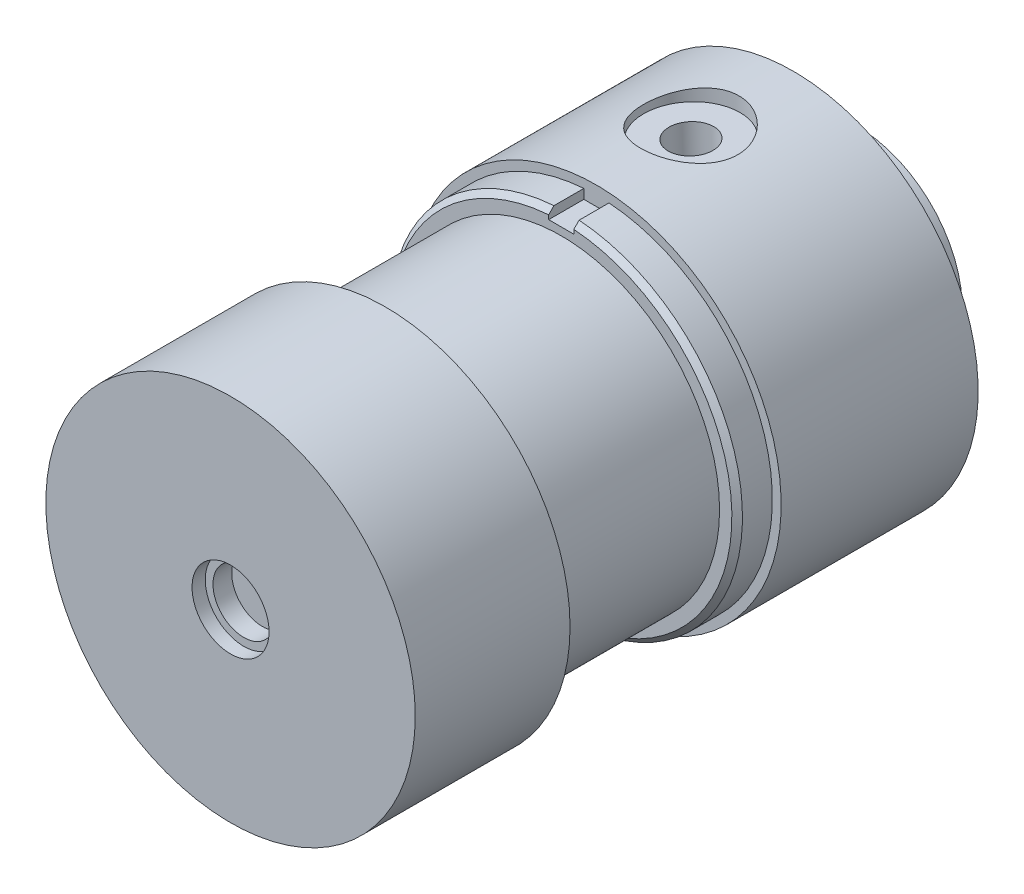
ISO-10303-21;
HEADER;
FILE_DESCRIPTION(('STEP AP214'),'2;1');
FILE_NAME('part.step','',(''),(''),'','','');
FILE_SCHEMA(('AUTOMOTIVE_DESIGN { 1 0 10303 214 1 1 1 1 }'));
ENDSEC;
DATA;
#1=APPLICATION_CONTEXT('core data for automotive mechanical design processes');
#2=APPLICATION_PROTOCOL_DEFINITION('international standard','automotive_design',2000,#1);
#3=PRODUCT_CONTEXT('',#1,'mechanical');
#4=PRODUCT('Part','Part','',(#3));
#5=PRODUCT_RELATED_PRODUCT_CATEGORY('part','',(#4));
#6=PRODUCT_DEFINITION_FORMATION('','',#4);
#7=PRODUCT_DEFINITION_CONTEXT('part definition',#1,'design');
#8=PRODUCT_DEFINITION('design','',#6,#7);
#9=PRODUCT_DEFINITION_SHAPE('','',#8);
#10=(LENGTH_UNIT() NAMED_UNIT(*) SI_UNIT(.MILLI.,.METRE.));
#11=(NAMED_UNIT(*) PLANE_ANGLE_UNIT() SI_UNIT($,.RADIAN.));
#12=(NAMED_UNIT(*) SI_UNIT($,.STERADIAN.) SOLID_ANGLE_UNIT());
#13=UNCERTAINTY_MEASURE_WITH_UNIT(LENGTH_MEASURE(1.E-05),#10,'distance_accuracy_value','');
#14=(GEOMETRIC_REPRESENTATION_CONTEXT(3) GLOBAL_UNCERTAINTY_ASSIGNED_CONTEXT((#13)) GLOBAL_UNIT_ASSIGNED_CONTEXT((#10,
#11,#12)) REPRESENTATION_CONTEXT('',''));
#15=CARTESIAN_POINT('',(0.,0.,0.));
#16=DIRECTION('',(0.,0.,1.));
#17=DIRECTION('',(1.,0.,0.));
#18=AXIS2_PLACEMENT_3D('',#15,#16,#17);
#19=CARTESIAN_POINT('',(0.00558795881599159,-0.145103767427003,24.8616081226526));
#20=DIRECTION('',(0.,0.,-1.));
#21=DIRECTION('',(-1.,0.,0.));
#22=AXIS2_PLACEMENT_3D('',#19,#20,#21);
#23=CYLINDRICAL_SURFACE('',#22,75.);
#24=DIRECTION('',(0.,0.,-1.));
#25=VECTOR('',#24,1.);
#26=CARTESIAN_POINT('',(5.36808795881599,74.6629412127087,24.8616081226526));
#27=LINE('',#26,#25);
#28=CARTESIAN_POINT('',(5.36808795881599,74.6629412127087,22.6116081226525));
#29=VERTEX_POINT('',#28);
#30=CARTESIAN_POINT('',(5.36808795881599,74.6629412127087,9.86160812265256));
#31=VERTEX_POINT('',#30);
#32=EDGE_CURVE('E160',#29,#31,#27,.T.);
#33=ORIENTED_EDGE('',*,*,#32,.F.);
#34=CARTESIAN_POINT('',(0.00558795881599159,-0.145103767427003,22.6116081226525));
#35=DIRECTION('',(0.,0.,1.));
#36=DIRECTION('',(1.,0.,0.));
#37=AXIS2_PLACEMENT_3D('',#34,#35,#36);
#38=CIRCLE('',#37,75.);
#39=CARTESIAN_POINT('',(-5.35691204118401,74.6629412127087,22.6116081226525));
#40=VERTEX_POINT('',#39);
#41=EDGE_CURVE('E65',#29,#40,#38,.F.);
#42=ORIENTED_EDGE('',*,*,#41,.T.);
#43=DIRECTION('',(0.,0.,-1.));
#44=VECTOR('',#43,1.);
#45=CARTESIAN_POINT('',(-5.35691204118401,74.6629412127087,24.8616081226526));
#46=LINE('',#45,#44);
#47=CARTESIAN_POINT('',(-5.35691204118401,74.6629412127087,9.86160812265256));
#48=VERTEX_POINT('',#47);
#49=EDGE_CURVE('E170',#40,#48,#46,.T.);
#50=ORIENTED_EDGE('',*,*,#49,.T.);
#51=CARTESIAN_POINT('',(0.00558795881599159,-0.145103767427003,9.86160812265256));
#52=DIRECTION('',(0.,0.,1.));
#53=DIRECTION('',(1.,0.,0.));
#54=AXIS2_PLACEMENT_3D('',#51,#52,#53);
#55=CIRCLE('',#54,75.);
#56=EDGE_CURVE('E112',#48,#31,#55,.T.);
#57=ORIENTED_EDGE('',*,*,#56,.T.);
#58=EDGE_LOOP('',(#33,#42,#50,#57));
#59=FACE_BOUND('',#58,.T.);
#60=ADVANCED_FACE('F50',(#59),#23,.T.);
#61=CARTESIAN_POINT('',(0.00558795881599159,-0.145103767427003,24.8616081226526));
#62=DIRECTION('',(0.,0.,1.));
#63=DIRECTION('',(1.,0.,0.));
#64=AXIS2_PLACEMENT_3D('',#61,#62,#63);
#65=PLANE('',#64);
#66=DIRECTION('',(0.,1.,0.));
#67=VECTOR('',#66,1.);
#68=CARTESIAN_POINT('',(-5.35691204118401,70.6129412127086,24.8616081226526));
#69=LINE('',#68,#67);
#70=CARTESIAN_POINT('',(-5.35691204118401,70.6129412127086,24.8616081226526));
#71=VERTEX_POINT('',#70);
#72=CARTESIAN_POINT('',(-5.35691204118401,72.4069885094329,24.8616081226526));
#73=VERTEX_POINT('',#72);
#74=EDGE_CURVE('E115',#71,#73,#69,.T.);
#75=ORIENTED_EDGE('',*,*,#74,.T.);
#76=CARTESIAN_POINT('',(0.00558795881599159,-0.145103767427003,24.8616081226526));
#77=DIRECTION('',(0.,0.,1.));
#78=DIRECTION('',(1.,0.,0.));
#79=AXIS2_PLACEMENT_3D('',#76,#77,#78);
#80=CIRCLE('',#79,72.75);
#81=CARTESIAN_POINT('',(5.36808795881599,72.4069885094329,24.8616081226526));
#82=VERTEX_POINT('',#81);
#83=EDGE_CURVE('E184',#73,#82,#80,.T.);
#84=ORIENTED_EDGE('',*,*,#83,.T.);
#85=DIRECTION('',(0.,1.,0.));
#86=VECTOR('',#85,1.);
#87=CARTESIAN_POINT('',(5.36808795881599,70.6129412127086,24.8616081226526));
#88=LINE('',#87,#86);
#89=CARTESIAN_POINT('',(5.36808795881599,70.6129412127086,24.8616081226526));
#90=VERTEX_POINT('',#89);
#91=EDGE_CURVE('E146',#90,#82,#88,.T.);
#92=ORIENTED_EDGE('',*,*,#91,.F.);
#93=DIRECTION('',(1.,0.,0.));
#94=VECTOR('',#93,1.);
#95=CARTESIAN_POINT('',(5.36808795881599,70.6129412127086,24.8616081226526));
#96=LINE('',#95,#94);
#97=EDGE_CURVE('E125',#71,#90,#96,.T.);
#98=ORIENTED_EDGE('',*,*,#97,.F.);
#99=EDGE_LOOP('',(#75,#84,#92,#98));
#100=FACE_BOUND('',#99,.T.);
#101=CARTESIAN_POINT('',(0.00558795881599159,-0.145103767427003,24.8616081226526));
#102=DIRECTION('',(0.,0.,1.));
#103=DIRECTION('',(1.,0.,0.));
#104=AXIS2_PLACEMENT_3D('',#101,#102,#103);
#105=CIRCLE('',#104,67.5);
#106=CARTESIAN_POINT('',(67.505587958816,-0.145103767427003,24.8616081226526));
#107=VERTEX_POINT('',#106);
#108=EDGE_CURVE('E155',#107,#107,#105,.T.);
#109=ORIENTED_EDGE('',*,*,#108,.F.);
#110=EDGE_LOOP('',(#109));
#111=FACE_BOUND('',#110,.T.);
#112=ADVANCED_FACE('F272',(#100,#111),#65,.T.);
#113=CARTESIAN_POINT('',(0.00558795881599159,-0.145103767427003,-74.1383918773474));
#114=DIRECTION('',(0.,0.,1.));
#115=DIRECTION('',(1.,0.,0.));
#116=AXIS2_PLACEMENT_3D('',#113,#114,#115);
#117=CYLINDRICAL_SURFACE('',#116,78.75);
#118=CARTESIAN_POINT('',(-23.1964049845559,75.1093314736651,-33.3472685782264));
#119=CARTESIAN_POINT('',(-23.1964027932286,75.1093329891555,-33.9036627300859));
#120=CARTESIAN_POINT('',(-23.1736237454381,75.1163668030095,-34.4601011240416));
#121=CARTESIAN_POINT('',(-23.0826919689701,75.1443114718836,-35.568939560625));
#122=CARTESIAN_POINT('',(-23.0145343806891,75.1652238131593,-36.1213391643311));
#123=CARTESIAN_POINT('',(-22.8333720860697,75.2203615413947,-37.2183406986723));
#124=CARTESIAN_POINT('',(-22.7203452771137,75.2545934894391,-37.7629386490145));
#125=CARTESIAN_POINT('',(-22.4503728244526,75.3354377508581,-38.8401738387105));
#126=CARTESIAN_POINT('',(-22.2934281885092,75.3820497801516,-39.3728113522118));
#127=CARTESIAN_POINT('',(-21.9370954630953,75.4863415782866,-40.4217579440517));
#128=CARTESIAN_POINT('',(-21.7377649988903,75.5440063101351,-40.9380881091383));
#129=CARTESIAN_POINT('',(-21.2980257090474,75.6689500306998,-41.9517336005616));
#130=CARTESIAN_POINT('',(-21.057616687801,75.7362290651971,-42.4490488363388));
#131=CARTESIAN_POINT('',(-20.537424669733,75.8787071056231,-43.4214581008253));
#132=CARTESIAN_POINT('',(-20.2576408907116,75.9539062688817,-43.8965516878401));
#133=CARTESIAN_POINT('',(-19.6605928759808,76.1103815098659,-44.8215155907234));
#134=CARTESIAN_POINT('',(-19.3433280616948,76.1916576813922,-45.2713855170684));
#135=CARTESIAN_POINT('',(-18.6663841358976,76.3600862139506,-46.1521906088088));
#136=CARTESIAN_POINT('',(-18.3059590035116,76.4473257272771,-46.5825359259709));
#137=CARTESIAN_POINT('',(-17.5505309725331,76.6240021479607,-47.4112414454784));
#138=CARTESIAN_POINT('',(-17.1555276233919,76.7134390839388,-47.8096012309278));
#139=CARTESIAN_POINT('',(-16.3334204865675,76.8923952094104,-48.5717610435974));
#140=CARTESIAN_POINT('',(-15.9063136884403,76.9819144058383,-48.9355578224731));
#141=CARTESIAN_POINT('',(-15.0227343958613,77.1589388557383,-49.6261025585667));
#142=CARTESIAN_POINT('',(-14.5662617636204,77.2464440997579,-49.9528503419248));
#143=CARTESIAN_POINT('',(-13.6199336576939,77.4186912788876,-50.5715418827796));
#144=CARTESIAN_POINT('',(-13.1296855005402,77.5033735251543,-50.8629020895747));
#145=CARTESIAN_POINT('',(-12.1252245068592,77.6666225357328,-51.4029313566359));
#146=CARTESIAN_POINT('',(-11.6110113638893,77.7451892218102,-51.6515998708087));
#147=CARTESIAN_POINT('',(-10.5622338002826,77.8943998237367,-52.1042483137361));
#148=CARTESIAN_POINT('',(-10.0276718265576,77.9650446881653,-52.3082335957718));
#149=CARTESIAN_POINT('',(-8.94195784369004,78.0968472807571,-52.6698555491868));
#150=CARTESIAN_POINT('',(-8.39080624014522,78.1580052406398,-52.8274933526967));
#151=CARTESIAN_POINT('',(-7.28779968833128,78.2683494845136,-53.0922208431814));
#152=CARTESIAN_POINT('',(-6.73620759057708,78.3177621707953,-53.2003117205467));
#153=CARTESIAN_POINT('',(-5.62501756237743,78.4053217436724,-53.3698605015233));
#154=CARTESIAN_POINT('',(-5.06541973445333,78.4434687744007,-53.431319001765));
#155=CARTESIAN_POINT('',(-3.94243589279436,78.5078801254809,-53.5070586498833));
#156=CARTESIAN_POINT('',(-3.37905039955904,78.5341460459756,-53.5213461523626));
#157=CARTESIAN_POINT('',(-2.25263352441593,78.5745286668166,-53.5026342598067));
#158=CARTESIAN_POINT('',(-1.68960213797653,78.588645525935,-53.4696354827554));
#159=CARTESIAN_POINT('',(-0.581190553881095,78.604615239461,-53.3579650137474));
#160=CARTESIAN_POINT('',(-0.0357048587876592,78.6067463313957,-53.2803760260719));
#161=CARTESIAN_POINT('',(1.04704866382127,78.5998704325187,-53.0810212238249));
#162=CARTESIAN_POINT('',(1.58431664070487,78.5908636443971,-52.9592562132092));
#163=CARTESIAN_POINT('',(2.64692621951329,78.5623822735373,-52.672530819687));
#164=CARTESIAN_POINT('',(3.17226741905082,78.5429073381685,-52.5075689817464));
#165=CARTESIAN_POINT('',(4.20744821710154,78.4944244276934,-52.1357394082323));
#166=CARTESIAN_POINT('',(4.71728758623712,78.4654163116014,-51.9288710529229));
#167=CARTESIAN_POINT('',(5.7227717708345,78.3987219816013,-51.4726531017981));
#168=CARTESIAN_POINT('',(6.2182393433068,78.3609571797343,-51.2229244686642));
#169=CARTESIAN_POINT('',(7.1866941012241,78.2783011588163,-50.6841688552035));
#170=CARTESIAN_POINT('',(7.65968121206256,78.2334099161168,-50.3951417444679));
#171=CARTESIAN_POINT('',(8.58020949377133,78.1380524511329,-49.7797468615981));
#172=CARTESIAN_POINT('',(9.02774679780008,78.0875853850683,-49.4533734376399));
#173=CARTESIAN_POINT('',(9.89446460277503,77.9827607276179,-48.7654872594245));
#174=CARTESIAN_POINT('',(10.3136445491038,77.9284030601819,-48.4039738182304));
#175=CARTESIAN_POINT('',(11.1324573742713,77.8159819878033,-47.6373858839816));
#176=CARTESIAN_POINT('',(11.5311972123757,77.7578571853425,-47.2313659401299));
#177=CARTESIAN_POINT('',(12.2931657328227,77.6413123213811,-46.3872976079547));
#178=CARTESIAN_POINT('',(12.6563937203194,77.5828922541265,-45.9492485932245));
#179=CARTESIAN_POINT('',(13.3448202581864,77.4677123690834,-45.0439680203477));
#180=CARTESIAN_POINT('',(13.6700165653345,77.4109526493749,-44.5767347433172));
#181=CARTESIAN_POINT('',(14.2799912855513,77.3010064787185,-43.6161865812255));
#182=CARTESIAN_POINT('',(14.5647698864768,77.2478200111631,-43.1228718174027));
#183=CARTESIAN_POINT('',(15.093150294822,77.1465565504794,-42.1107608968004));
#184=CARTESIAN_POINT('',(15.3365240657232,77.0985083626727,-41.5918427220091));
#185=CARTESIAN_POINT('',(15.7782549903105,77.0095220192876,-40.5345823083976));
#186=CARTESIAN_POINT('',(15.9766118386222,76.9685839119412,-39.9962399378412));
#187=CARTESIAN_POINT('',(16.3265780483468,76.8952738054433,-38.9041008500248));
#188=CARTESIAN_POINT('',(16.478196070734,76.8629002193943,-38.3503070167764));
#189=CARTESIAN_POINT('',(16.7333722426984,76.8078741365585,-37.2312830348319));
#190=CARTESIAN_POINT('',(16.8369317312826,76.7852213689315,-36.6660532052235));
#191=CARTESIAN_POINT('',(16.9928456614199,76.7509413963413,-35.5442105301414));
#192=CARTESIAN_POINT('',(17.0465378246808,76.7390264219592,-34.9877920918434));
#193=CARTESIAN_POINT('',(17.1071011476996,76.725578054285,-33.8722911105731));
#194=CARTESIAN_POINT('',(17.1139731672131,76.7240444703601,-33.3132086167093));
#195=CARTESIAN_POINT('',(17.080836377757,76.7314119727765,-32.1965569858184));
#196=CARTESIAN_POINT('',(17.0408317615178,76.7403121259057,-31.6389877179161));
#197=CARTESIAN_POINT('',(16.9143100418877,76.7682357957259,-30.5294126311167));
#198=CARTESIAN_POINT('',(16.8277931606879,76.7872592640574,-29.9774067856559));
#199=CARTESIAN_POINT('',(16.6109221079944,76.8343573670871,-28.8924950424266));
#200=CARTESIAN_POINT('',(16.4813573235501,76.8622686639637,-28.3594239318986));
#201=CARTESIAN_POINT('',(16.1791400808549,76.9263082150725,-27.3061606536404));
#202=CARTESIAN_POINT('',(16.0064882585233,76.9624363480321,-26.785968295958));
#203=CARTESIAN_POINT('',(15.6194502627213,77.0417396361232,-25.761858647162));
#204=CARTESIAN_POINT('',(15.4050602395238,77.0849154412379,-25.2579428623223));
#205=CARTESIAN_POINT('',(14.9361771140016,77.1769309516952,-24.2696666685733));
#206=CARTESIAN_POINT('',(14.6816831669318,77.2257707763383,-23.7853066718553));
#207=CARTESIAN_POINT('',(14.1288192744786,77.3286174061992,-22.829484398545));
#208=CARTESIAN_POINT('',(13.8296578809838,77.3827095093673,-22.3584890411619));
#209=CARTESIAN_POINT('',(13.1936144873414,77.4934344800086,-21.4430176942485));
#210=CARTESIAN_POINT('',(12.8567320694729,77.5500673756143,-20.9985419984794));
#211=CARTESIAN_POINT('',(12.1474943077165,77.6640575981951,-20.1388439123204));
#212=CARTESIAN_POINT('',(11.77513363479,77.7214150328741,-19.7236259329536));
#213=CARTESIAN_POINT('',(10.99744121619,77.8349966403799,-18.9251355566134));
#214=CARTESIAN_POINT('',(10.5921089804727,77.8912207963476,-18.5418636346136));
#215=CARTESIAN_POINT('',(9.73996986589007,78.0021528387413,-17.8000433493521));
#216=CARTESIAN_POINT('',(9.29234979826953,78.0567813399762,-17.4424165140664));
#217=CARTESIAN_POINT('',(8.36816272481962,78.1610010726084,-16.7659075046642));
#218=CARTESIAN_POINT('',(7.89159515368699,78.2105922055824,-16.4470260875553));
#219=CARTESIAN_POINT('',(6.91278407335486,78.302934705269,-15.8503379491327));
#220=CARTESIAN_POINT('',(6.41054135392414,78.3456862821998,-15.5725299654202));
#221=CARTESIAN_POINT('',(5.38386228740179,78.4227116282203,-15.0600978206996));
#222=CARTESIAN_POINT('',(4.85942628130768,78.4569855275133,-14.8254729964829));
#223=CARTESIAN_POINT('',(3.79606600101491,78.5154083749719,-14.4028598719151));
#224=CARTESIAN_POINT('',(3.25727857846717,78.5396307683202,-14.2145375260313));
#225=CARTESIAN_POINT('',(2.16540184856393,78.5771679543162,-13.8838375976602));
#226=CARTESIAN_POINT('',(1.61231256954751,78.5904827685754,-13.7414599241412));
#227=CARTESIAN_POINT('',(0.496026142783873,78.6053468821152,-13.5038952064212));
#228=CARTESIAN_POINT('',(-0.0671692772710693,78.6068981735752,-13.4087001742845));
#229=CARTESIAN_POINT('',(-1.19949369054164,78.5977104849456,-13.2663116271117));
#230=CARTESIAN_POINT('',(-1.76862254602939,78.5869717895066,-13.2191170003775));
#231=CARTESIAN_POINT('',(-2.89227670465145,78.5535101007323,-13.1738032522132));
#232=CARTESIAN_POINT('',(-3.44675822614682,78.5311357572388,-13.1743297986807));
#233=CARTESIAN_POINT('',(-4.55319029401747,78.4747847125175,-13.2210895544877));
#234=CARTESIAN_POINT('',(-5.10514089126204,78.440808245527,-13.2673218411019));
#235=CARTESIAN_POINT('',(-6.20252543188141,78.3617396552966,-13.4050948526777));
#236=CARTESIAN_POINT('',(-6.7479596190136,78.3166479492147,-13.4966338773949));
#237=CARTESIAN_POINT('',(-7.82848065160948,78.2161385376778,-13.7242528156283));
#238=CARTESIAN_POINT('',(-8.36356745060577,78.1607207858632,-13.8603329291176));
#239=CARTESIAN_POINT('',(-9.41656274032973,78.0409866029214,-14.1749886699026));
#240=CARTESIAN_POINT('',(-9.93455434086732,77.9767249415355,-14.3533072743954));
#241=CARTESIAN_POINT('',(-10.9532358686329,77.8403486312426,-14.7514825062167));
#242=CARTESIAN_POINT('',(-11.4539259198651,77.7682340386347,-14.9713388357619));
#243=CARTESIAN_POINT('',(-12.4348519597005,77.6176394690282,-15.4509887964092));
#244=CARTESIAN_POINT('',(-12.9150859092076,77.5391588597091,-15.7107863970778));
#245=CARTESIAN_POINT('',(-13.8520706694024,77.377498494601,-16.268473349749));
#246=CARTESIAN_POINT('',(-14.3088209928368,77.2943186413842,-16.5663634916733));
#247=CARTESIAN_POINT('',(-15.2071394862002,77.1229343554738,-17.206118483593));
#248=CARTESIAN_POINT('',(-15.6480444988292,77.0346563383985,-17.5488950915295));
#249=CARTESIAN_POINT('',(-16.4995009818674,76.8570632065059,-18.2700344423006));
#250=CARTESIAN_POINT('',(-16.9100519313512,76.7677480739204,-18.648397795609));
#251=CARTESIAN_POINT('',(-17.6983188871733,76.5901390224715,-19.4383215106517));
#252=CARTESIAN_POINT('',(-18.0760267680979,76.5018453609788,-19.8498900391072));
#253=CARTESIAN_POINT('',(-18.7960884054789,76.3283991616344,-20.7034896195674));
#254=CARTESIAN_POINT('',(-19.1384421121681,76.2432466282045,-21.145520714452));
#255=CARTESIAN_POINT('',(-19.7919876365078,76.0765107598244,-22.0662809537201));
#256=CARTESIAN_POINT('',(-20.1024255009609,75.9950319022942,-22.5455645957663));
#257=CARTESIAN_POINT('',(-20.6820083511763,75.8396047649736,-23.5296825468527));
#258=CARTESIAN_POINT('',(-20.9511514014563,75.7656568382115,-24.0345180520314));
#259=CARTESIAN_POINT('',(-21.445966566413,75.6273140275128,-25.0659284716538));
#260=CARTESIAN_POINT('',(-21.671665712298,75.5629132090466,-25.5924896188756));
#261=CARTESIAN_POINT('',(-22.0780066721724,75.4453860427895,-26.6638927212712));
#262=CARTESIAN_POINT('',(-22.2586550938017,75.3922580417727,-27.2087319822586));
#263=CARTESIAN_POINT('',(-22.545060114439,75.3071911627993,-28.213202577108));
#264=CARTESIAN_POINT('',(-22.6584459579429,75.2731592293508,-28.6704990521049));
#265=CARTESIAN_POINT('',(-22.8533446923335,75.2143156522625,-29.5925649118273));
#266=CARTESIAN_POINT('',(-22.9348494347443,75.1895063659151,-30.0573361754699));
#267=CARTESIAN_POINT('',(-23.0654440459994,75.1496148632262,-30.9917901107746));
#268=CARTESIAN_POINT('',(-23.114536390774,75.1345319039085,-31.4614724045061));
#269=CARTESIAN_POINT('',(-23.1800133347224,75.1143909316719,-32.4031824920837));
#270=CARTESIAN_POINT('',(-23.1964068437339,75.1093301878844,-32.8752096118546));
#271=CARTESIAN_POINT('',(-23.1964049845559,75.1093314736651,-33.3472685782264));
#272=B_SPLINE_CURVE_WITH_KNOTS('',3,(#118,#119,#120,#121,#122,#123,#124,#125,#126,#127,#128,
#129,#130,#131,#132,#133,#134,#135,#136,#137,#138,#139,#140,#141,#142,#143,#144,#145,#146,#147,
#148,#149,#150,#151,#152,#153,#154,#155,#156,#157,#158,#159,#160,#161,#162,#163,#164,#165,#166,
#167,#168,#169,#170,#171,#172,#173,#174,#175,#176,#177,#178,#179,#180,#181,#182,#183,#184,#185,
#186,#187,#188,#189,#190,#191,#192,#193,#194,#195,#196,#197,#198,#199,#200,#201,#202,#203,#204,
#205,#206,#207,#208,#209,#210,#211,#212,#213,#214,#215,#216,#217,#218,#219,#220,#221,#222,#223,
#224,#225,#226,#227,#228,#229,#230,#231,#232,#233,#234,#235,#236,#237,#238,#239,#240,#241,#242,
#243,#244,#245,#246,#247,#248,#249,#250,#251,#252,#253,#254,#255,#256,#257,#258,#259,#260,#261,
#262,#263,#264,#265,#266,#267,#268,#269,#270,#271),.UNSPECIFIED.,.T.,.F.,(4,2,2,2,2,2,2,2,2,2,2,
2,2,2,2,2,2,2,2,2,2,2,2,2,2,2,2,2,2,2,2,2,2,2,2,2,2,2,2,2,2,2,2,2,2,2,2,2,2,2,2,2,2,2,2,2,2,2,2,
2,2,2,2,2,2,2,2,2,2,2,2,2,2,2,2,2,4),(0.,1.66875045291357,3.3376796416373,5.00743196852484,
6.67714598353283,8.34460430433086,10.0120705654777,11.6795699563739,13.3470950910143,
15.0493655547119,16.7516582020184,18.4541106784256,20.1565711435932,21.8841085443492,
23.6116680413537,25.3390204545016,27.0663306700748,28.75700540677,30.447658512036,
32.138083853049,33.8284871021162,35.4794820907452,37.1304470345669,38.7814675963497,
40.4325125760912,42.0989915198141,43.7654759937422,45.4322130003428,47.0989825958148,
48.8130811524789,50.5272132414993,52.2414463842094,53.9556715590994,55.6790519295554,
57.4024439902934,59.1255165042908,60.8485410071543,62.5238831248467,64.1991944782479,
65.874356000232,67.5495095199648,69.1955001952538,70.8414665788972,72.4875848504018,
74.1337378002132,75.8135847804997,77.4934503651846,79.1735686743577,80.8537119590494,
82.5782745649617,84.3028708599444,86.0274141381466,87.7519309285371,89.4636150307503,
91.175295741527,92.8866865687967,94.5980377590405,96.2608362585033,97.9236011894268,
99.5863037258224,101.249013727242,102.901854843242,104.554684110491,106.207677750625,
107.860705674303,109.554978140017,111.249279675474,112.943999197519,114.638721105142,
116.367101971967,118.095563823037,119.822946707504,121.550076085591,122.966018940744,
124.382323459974,125.798519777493,127.214330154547),.UNSPECIFIED.);
#273=CARTESIAN_POINT('',(-23.1964049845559,75.1093314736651,-33.3472685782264));
#274=VERTEX_POINT('',#273);
#275=EDGE_CURVE('E175',#274,#274,#272,.T.);
#276=ORIENTED_EDGE('',*,*,#275,.T.);
#277=EDGE_LOOP('',(#276));
#278=FACE_BOUND('',#277,.T.);
#279=CARTESIAN_POINT('',(0.00558795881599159,-0.145103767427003,-74.1383918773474));
#280=DIRECTION('',(0.,0.,-1.));
#281=DIRECTION('',(-1.,0.,0.));
#282=AXIS2_PLACEMENT_3D('',#279,#280,#281);
#283=CIRCLE('',#282,78.75);
#284=CARTESIAN_POINT('',(-78.744412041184,-0.145103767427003,-74.1383918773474));
#285=VERTEX_POINT('',#284);
#286=EDGE_CURVE('E161',#285,#285,#283,.T.);
#287=ORIENTED_EDGE('',*,*,#286,.F.);
#288=EDGE_LOOP('',(#287));
#289=FACE_BOUND('',#288,.T.);
#290=CARTESIAN_POINT('',(0.00558795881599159,-0.145103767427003,9.86160812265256));
#291=DIRECTION('',(0.,0.,-1.));
#292=DIRECTION('',(-1.,0.,0.));
#293=AXIS2_PLACEMENT_3D('',#290,#291,#292);
#294=CIRCLE('',#293,78.75);
#295=CARTESIAN_POINT('',(-78.744412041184,-0.145103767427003,9.86160812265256));
#296=VERTEX_POINT('',#295);
#297=EDGE_CURVE('E154',#296,#296,#294,.T.);
#298=ORIENTED_EDGE('',*,*,#297,.T.);
#299=EDGE_LOOP('',(#298));
#300=FACE_BOUND('',#299,.T.);
#301=ADVANCED_FACE('F186',(#278,#289,#300),#117,.T.);
#302=CARTESIAN_POINT('',(0.00558795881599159,-0.145103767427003,-74.1383918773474));
#303=DIRECTION('',(0.,0.,-1.));
#304=DIRECTION('',(-1.,0.,0.));
#305=AXIS2_PLACEMENT_3D('',#302,#303,#304);
#306=PLANE('',#305);
#307=CARTESIAN_POINT('',(63.755587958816,-0.145103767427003,-74.1383918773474));
#308=DIRECTION('',(0.,0.,-1.));
#309=DIRECTION('',(-1.,0.,0.));
#310=AXIS2_PLACEMENT_3D('',#307,#308,#309);
#311=CIRCLE('',#310,7.5);
#312=CARTESIAN_POINT('',(56.255587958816,-0.145103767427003,-74.1383918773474));
#313=VERTEX_POINT('',#312);
#314=EDGE_CURVE('E384',#313,#313,#311,.T.);
#315=ORIENTED_EDGE('',*,*,#314,.F.);
#316=EDGE_LOOP('',(#315));
#317=FACE_BOUND('',#316,.T.);
#318=CARTESIAN_POINT('',(31.880587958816,-55.354223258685,-74.1383918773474));
#319=DIRECTION('',(0.,0.,-1.));
#320=DIRECTION('',(-1.,0.,0.));
#321=AXIS2_PLACEMENT_3D('',#318,#319,#320);
#322=CIRCLE('',#321,7.5);
#323=CARTESIAN_POINT('',(24.380587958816,-55.354223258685,-74.1383918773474));
#324=VERTEX_POINT('',#323);
#325=EDGE_CURVE('E392',#324,#324,#322,.T.);
#326=ORIENTED_EDGE('',*,*,#325,.F.);
#327=EDGE_LOOP('',(#326));
#328=FACE_BOUND('',#327,.T.);
#329=CARTESIAN_POINT('',(-31.869412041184,-55.354223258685,-74.1383918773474));
#330=DIRECTION('',(0.,0.,-1.));
#331=DIRECTION('',(-1.,0.,0.));
#332=AXIS2_PLACEMENT_3D('',#329,#330,#331);
#333=CIRCLE('',#332,7.5);
#334=CARTESIAN_POINT('',(-39.369412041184,-55.354223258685,-74.1383918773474));
#335=VERTEX_POINT('',#334);
#336=EDGE_CURVE('E391',#335,#335,#333,.T.);
#337=ORIENTED_EDGE('',*,*,#336,.F.);
#338=EDGE_LOOP('',(#337));
#339=FACE_BOUND('',#338,.T.);
#340=CARTESIAN_POINT('',(-63.744412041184,-0.145103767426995,-74.1383918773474));
#341=DIRECTION('',(0.,0.,-1.));
#342=DIRECTION('',(-1.,0.,0.));
#343=AXIS2_PLACEMENT_3D('',#340,#341,#342);
#344=CIRCLE('',#343,7.5);
#345=CARTESIAN_POINT('',(-71.244412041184,-0.145103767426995,-74.1383918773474));
#346=VERTEX_POINT('',#345);
#347=EDGE_CURVE('E400',#346,#346,#344,.T.);
#348=ORIENTED_EDGE('',*,*,#347,.F.);
#349=EDGE_LOOP('',(#348));
#350=FACE_BOUND('',#349,.T.);
#351=CARTESIAN_POINT('',(-31.869412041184,55.064015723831,-74.1383918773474));
#352=DIRECTION('',(0.,0.,-1.));
#353=DIRECTION('',(-1.,0.,0.));
#354=AXIS2_PLACEMENT_3D('',#351,#352,#353);
#355=CIRCLE('',#354,7.5);
#356=CARTESIAN_POINT('',(-39.369412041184,55.064015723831,-74.1383918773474));
#357=VERTEX_POINT('',#356);
#358=EDGE_CURVE('E408',#357,#357,#355,.T.);
#359=ORIENTED_EDGE('',*,*,#358,.F.);
#360=EDGE_LOOP('',(#359));
#361=FACE_BOUND('',#360,.T.);
#362=CARTESIAN_POINT('',(31.880587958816,55.064015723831,-74.1383918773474));
#363=DIRECTION('',(0.,0.,-1.));
#364=DIRECTION('',(-1.,0.,0.));
#365=AXIS2_PLACEMENT_3D('',#362,#363,#364);
#366=CIRCLE('',#365,7.5);
#367=CARTESIAN_POINT('',(24.380587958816,55.064015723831,-74.1383918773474));
#368=VERTEX_POINT('',#367);
#369=EDGE_CURVE('E416',#368,#368,#366,.T.);
#370=ORIENTED_EDGE('',*,*,#369,.F.);
#371=EDGE_LOOP('',(#370));
#372=FACE_BOUND('',#371,.T.);
#373=CARTESIAN_POINT('',(0.00558795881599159,-0.145103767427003,-74.1383918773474));
#374=DIRECTION('',(0.,0.,-1.));
#375=DIRECTION('',(-1.,0.,0.));
#376=AXIS2_PLACEMENT_3D('',#373,#374,#375);
#377=CIRCLE('',#376,45.);
#378=CARTESIAN_POINT('',(-44.994412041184,-0.145103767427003,-74.1383918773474));
#379=VERTEX_POINT('',#378);
#380=EDGE_CURVE('E159',#379,#379,#377,.T.);
#381=ORIENTED_EDGE('',*,*,#380,.F.);
#382=EDGE_LOOP('',(#381));
#383=FACE_BOUND('',#382,.T.);
#384=ORIENTED_EDGE('',*,*,#286,.T.);
#385=EDGE_LOOP('',(#384));
#386=FACE_BOUND('',#385,.T.);
#387=ADVANCED_FACE('F263',(#317,#328,#339,#350,#361,#372,#383,#386),#306,.T.);
#388=CARTESIAN_POINT('',(0.00558795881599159,-0.145103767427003,9.86160812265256));
#389=DIRECTION('',(0.,0.,-1.));
#390=DIRECTION('',(-1.,0.,0.));
#391=AXIS2_PLACEMENT_3D('',#388,#389,#390);
#392=PLANE('',#391);
#393=ORIENTED_EDGE('',*,*,#56,.F.);
#394=DIRECTION('',(0.,1.,0.));
#395=VECTOR('',#394,1.);
#396=CARTESIAN_POINT('',(-5.35691204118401,70.6129412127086,9.86160812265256));
#397=LINE('',#396,#395);
#398=CARTESIAN_POINT('',(-5.35691204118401,70.6129412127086,9.86160812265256));
#399=VERTEX_POINT('',#398);
#400=EDGE_CURVE('E103',#399,#48,#397,.T.);
#401=ORIENTED_EDGE('',*,*,#400,.F.);
#402=DIRECTION('',(-1.,0.,0.));
#403=VECTOR('',#402,1.);
#404=CARTESIAN_POINT('',(-5.35691204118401,70.6129412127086,9.86160812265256));
#405=LINE('',#404,#403);
#406=CARTESIAN_POINT('',(5.36808795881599,70.6129412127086,9.86160812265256));
#407=VERTEX_POINT('',#406);
#408=EDGE_CURVE('E109',#407,#399,#405,.T.);
#409=ORIENTED_EDGE('',*,*,#408,.F.);
#410=DIRECTION('',(0.,1.,0.));
#411=VECTOR('',#410,1.);
#412=CARTESIAN_POINT('',(5.36808795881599,70.6129412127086,9.86160812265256));
#413=LINE('',#412,#411);
#414=EDGE_CURVE('E142',#407,#31,#413,.T.);
#415=ORIENTED_EDGE('',*,*,#414,.T.);
#416=EDGE_LOOP('',(#393,#401,#409,#415));
#417=FACE_BOUND('',#416,.T.);
#418=ORIENTED_EDGE('',*,*,#297,.F.);
#419=EDGE_LOOP('',(#418));
#420=FACE_BOUND('',#419,.T.);
#421=ADVANCED_FACE('F105',(#417,#420),#392,.F.);
#422=CARTESIAN_POINT('',(0.00558795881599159,-0.145103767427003,99.8616081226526));
#423=DIRECTION('',(0.,0.,-1.));
#424=DIRECTION('',(-1.,0.,0.));
#425=AXIS2_PLACEMENT_3D('',#422,#423,#424);
#426=CYLINDRICAL_SURFACE('',#425,67.5);
#427=CARTESIAN_POINT('',(0.00558795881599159,-0.145103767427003,99.8616081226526));
#428=DIRECTION('',(0.,0.,1.));
#429=DIRECTION('',(1.,0.,0.));
#430=AXIS2_PLACEMENT_3D('',#427,#428,#429);
#431=CIRCLE('',#430,67.5);
#432=CARTESIAN_POINT('',(67.505587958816,-0.145103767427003,99.8616081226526));
#433=VERTEX_POINT('',#432);
#434=EDGE_CURVE('E145',#433,#433,#431,.T.);
#435=ORIENTED_EDGE('',*,*,#434,.F.);
#436=EDGE_LOOP('',(#435));
#437=FACE_BOUND('',#436,.T.);
#438=ORIENTED_EDGE('',*,*,#108,.T.);
#439=EDGE_LOOP('',(#438));
#440=FACE_BOUND('',#439,.T.);
#441=ADVANCED_FACE('F276',(#437,#440),#426,.T.);
#442=CARTESIAN_POINT('',(5.36808795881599,70.6129412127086,24.8616081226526));
#443=DIRECTION('',(1.,0.,0.));
#444=DIRECTION('',(0.,1.,0.));
#445=AXIS2_PLACEMENT_3D('',#442,#443,#444);
#446=PLANE('',#445);
#447=ORIENTED_EDGE('',*,*,#91,.T.);
#448=CARTESIAN_POINT('',(5.36808795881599,72.4069885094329,24.8616081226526));
#449=CARTESIAN_POINT('',(5.36808795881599,72.7829957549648,24.4866232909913));
#450=CARTESIAN_POINT('',(5.36808795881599,73.1589954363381,24.1116308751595));
#451=CARTESIAN_POINT('',(5.36808795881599,73.9109796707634,23.3616308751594));
#452=CARTESIAN_POINT('',(5.36808795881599,74.2869642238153,22.9866232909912));
#453=CARTESIAN_POINT('',(5.36808795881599,74.6629412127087,22.6116081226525));
#454=B_SPLINE_CURVE_WITH_KNOTS('',3,(#448,#449,#450,#451,#452,#453),.UNSPECIFIED.,.F.,.F.,(4,2,
4),(0.,1.59309624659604,3.18619249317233),.UNSPECIFIED.);
#455=EDGE_CURVE('E79',#82,#29,#454,.T.);
#456=ORIENTED_EDGE('',*,*,#455,.T.);
#457=ORIENTED_EDGE('',*,*,#32,.T.);
#458=ORIENTED_EDGE('',*,*,#414,.F.);
#459=DIRECTION('',(0.,0.,-1.));
#460=VECTOR('',#459,1.);
#461=CARTESIAN_POINT('',(5.36808795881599,70.6129412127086,24.8616081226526));
#462=LINE('',#461,#460);
#463=EDGE_CURVE('E116',#90,#407,#462,.T.);
#464=ORIENTED_EDGE('',*,*,#463,.F.);
#465=EDGE_LOOP('',(#447,#456,#457,#458,#464));
#466=FACE_BOUND('',#465,.T.);
#467=ADVANCED_FACE('F280',(#466),#446,.F.);
#468=CARTESIAN_POINT('',(-5.35691204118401,70.6129412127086,24.8616081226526));
#469=DIRECTION('',(-1.,0.,0.));
#470=DIRECTION('',(0.,-1.,0.));
#471=AXIS2_PLACEMENT_3D('',#468,#469,#470);
#472=PLANE('',#471);
#473=ORIENTED_EDGE('',*,*,#49,.F.);
#474=CARTESIAN_POINT('',(-5.35691204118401,74.6629412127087,22.6116081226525));
#475=CARTESIAN_POINT('',(-5.35691204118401,74.2869642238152,22.9866232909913));
#476=CARTESIAN_POINT('',(-5.35691204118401,73.9109796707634,23.3616308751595));
#477=CARTESIAN_POINT('',(-5.35691204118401,73.1589954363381,24.1116308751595));
#478=CARTESIAN_POINT('',(-5.35691204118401,72.7829957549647,24.4866232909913));
#479=CARTESIAN_POINT('',(-5.35691204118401,72.4069885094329,24.8616081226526));
#480=B_SPLINE_CURVE_WITH_KNOTS('',3,(#474,#475,#476,#477,#478,#479),.UNSPECIFIED.,.F.,.F.,(4,2,
4),(0.,1.5930962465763,3.18619249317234),.UNSPECIFIED.);
#481=EDGE_CURVE('E12',#40,#73,#480,.T.);
#482=ORIENTED_EDGE('',*,*,#481,.T.);
#483=ORIENTED_EDGE('',*,*,#74,.F.);
#484=DIRECTION('',(0.,0.,1.));
#485=VECTOR('',#484,1.);
#486=CARTESIAN_POINT('',(-5.35691204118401,70.6129412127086,24.8616081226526));
#487=LINE('',#486,#485);
#488=EDGE_CURVE('E119',#399,#71,#487,.T.);
#489=ORIENTED_EDGE('',*,*,#488,.F.);
#490=ORIENTED_EDGE('',*,*,#400,.T.);
#491=EDGE_LOOP('',(#473,#482,#483,#489,#490));
#492=FACE_BOUND('',#491,.T.);
#493=ADVANCED_FACE('F120',(#492),#472,.F.);
#494=CARTESIAN_POINT('',(0.00558795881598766,70.6129412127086,9.86160812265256));
#495=DIRECTION('',(0.,1.,0.));
#496=DIRECTION('',(0.,0.,1.));
#497=AXIS2_PLACEMENT_3D('',#494,#495,#496);
#498=PLANE('',#497);
#499=ORIENTED_EDGE('',*,*,#408,.T.);
#500=ORIENTED_EDGE('',*,*,#488,.T.);
#501=ORIENTED_EDGE('',*,*,#97,.T.);
#502=ORIENTED_EDGE('',*,*,#463,.T.);
#503=EDGE_LOOP('',(#499,#500,#501,#502));
#504=FACE_BOUND('',#503,.T.);
#505=ADVANCED_FACE('F127',(#504),#498,.T.);
#506=CARTESIAN_POINT('',(0.00558795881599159,-0.145103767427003,165.861608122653));
#507=DIRECTION('',(0.,0.,-1.));
#508=DIRECTION('',(-1.,0.,0.));
#509=AXIS2_PLACEMENT_3D('',#506,#507,#508);
#510=CYLINDRICAL_SURFACE('',#509,78.75);
#511=CARTESIAN_POINT('',(0.00558795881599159,-0.145103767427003,165.861608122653));
#512=DIRECTION('',(0.,0.,1.));
#513=DIRECTION('',(1.,0.,0.));
#514=AXIS2_PLACEMENT_3D('',#511,#512,#513);
#515=CIRCLE('',#514,78.75);
#516=CARTESIAN_POINT('',(78.755587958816,-0.145103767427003,165.861608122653));
#517=VERTEX_POINT('',#516);
#518=EDGE_CURVE('E130',#517,#517,#515,.T.);
#519=ORIENTED_EDGE('',*,*,#518,.F.);
#520=EDGE_LOOP('',(#519));
#521=FACE_BOUND('',#520,.T.);
#522=CARTESIAN_POINT('',(0.00558795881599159,-0.145103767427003,99.8616081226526));
#523=DIRECTION('',(0.,0.,1.));
#524=DIRECTION('',(1.,0.,0.));
#525=AXIS2_PLACEMENT_3D('',#522,#523,#524);
#526=CIRCLE('',#525,78.75);
#527=CARTESIAN_POINT('',(78.755587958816,-0.145103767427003,99.8616081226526));
#528=VERTEX_POINT('',#527);
#529=EDGE_CURVE('E134',#528,#528,#526,.T.);
#530=ORIENTED_EDGE('',*,*,#529,.T.);
#531=EDGE_LOOP('',(#530));
#532=FACE_BOUND('',#531,.T.);
#533=ADVANCED_FACE('F308',(#521,#532),#510,.T.);
#534=CARTESIAN_POINT('',(0.00558795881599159,-0.145103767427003,165.861608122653));
#535=DIRECTION('',(0.,0.,1.));
#536=DIRECTION('',(1.,0.,0.));
#537=AXIS2_PLACEMENT_3D('',#534,#535,#536);
#538=PLANE('',#537);
#539=CARTESIAN_POINT('',(0.00558795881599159,-0.145103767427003,165.861608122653));
#540=DIRECTION('',(0.,0.,1.));
#541=DIRECTION('',(1.,0.,0.));
#542=AXIS2_PLACEMENT_3D('',#539,#540,#541);
#543=CIRCLE('',#542,16.419375);
#544=CARTESIAN_POINT('',(16.424962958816,-0.145103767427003,165.861608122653));
#545=VERTEX_POINT('',#544);
#546=EDGE_CURVE('E237',#545,#545,#543,.T.);
#547=ORIENTED_EDGE('',*,*,#546,.F.);
#548=EDGE_LOOP('',(#547));
#549=FACE_BOUND('',#548,.T.);
#550=ORIENTED_EDGE('',*,*,#518,.T.);
#551=EDGE_LOOP('',(#550));
#552=FACE_BOUND('',#551,.T.);
#553=ADVANCED_FACE('F312',(#549,#552),#538,.T.);
#554=CARTESIAN_POINT('',(0.00558795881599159,-0.145103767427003,99.8616081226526));
#555=DIRECTION('',(0.,0.,1.));
#556=DIRECTION('',(1.,0.,0.));
#557=AXIS2_PLACEMENT_3D('',#554,#555,#556);
#558=PLANE('',#557);
#559=ORIENTED_EDGE('',*,*,#434,.T.);
#560=EDGE_LOOP('',(#559));
#561=FACE_BOUND('',#560,.T.);
#562=ORIENTED_EDGE('',*,*,#529,.F.);
#563=EDGE_LOOP('',(#562));
#564=FACE_BOUND('',#563,.T.);
#565=ADVANCED_FACE('F317',(#561,#564),#558,.F.);
#566=CARTESIAN_POINT('',(0.00558795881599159,-0.145103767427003,-101.138391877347));
#567=DIRECTION('',(0.,0.,1.));
#568=DIRECTION('',(1.,0.,0.));
#569=AXIS2_PLACEMENT_3D('',#566,#567,#568);
#570=CYLINDRICAL_SURFACE('',#569,45.);
#571=CARTESIAN_POINT('',(0.00558795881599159,-0.145103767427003,-101.138391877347));
#572=DIRECTION('',(0.,0.,-1.));
#573=DIRECTION('',(-1.,0.,0.));
#574=AXIS2_PLACEMENT_3D('',#571,#572,#573);
#575=CIRCLE('',#574,45.);
#576=CARTESIAN_POINT('',(-44.994412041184,-0.145103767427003,-101.138391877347));
#577=VERTEX_POINT('',#576);
#578=EDGE_CURVE('E253',#577,#577,#575,.T.);
#579=ORIENTED_EDGE('',*,*,#578,.F.);
#580=EDGE_LOOP('',(#579));
#581=FACE_BOUND('',#580,.T.);
#582=ORIENTED_EDGE('',*,*,#380,.T.);
#583=EDGE_LOOP('',(#582));
#584=FACE_BOUND('',#583,.T.);
#585=ADVANCED_FACE('F261',(#581,#584),#570,.T.);
#586=CARTESIAN_POINT('',(0.00558795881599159,-0.145103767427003,-101.138391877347));
#587=DIRECTION('',(0.,0.,-1.));
#588=DIRECTION('',(-1.,0.,0.));
#589=AXIS2_PLACEMENT_3D('',#586,#587,#588);
#590=PLANE('',#589);
#591=CARTESIAN_POINT('',(0.00558795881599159,-0.145103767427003,-101.138391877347));
#592=DIRECTION('',(0.,0.,-1.));
#593=DIRECTION('',(-1.,0.,0.));
#594=AXIS2_PLACEMENT_3D('',#591,#592,#593);
#595=CIRCLE('',#594,32.88);
#596=CARTESIAN_POINT('',(-32.874412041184,-0.145103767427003,-101.138391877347));
#597=VERTEX_POINT('',#596);
#598=EDGE_CURVE('E219',#597,#597,#595,.T.);
#599=ORIENTED_EDGE('',*,*,#598,.F.);
#600=EDGE_LOOP('',(#599));
#601=FACE_BOUND('',#600,.T.);
#602=ORIENTED_EDGE('',*,*,#578,.T.);
#603=EDGE_LOOP('',(#602));
#604=FACE_BOUND('',#603,.T.);
#605=ADVANCED_FACE('F328',(#601,#604),#590,.T.);
#606=CARTESIAN_POINT('',(0.00558795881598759,-0.145103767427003,152.234108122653));
#607=DIRECTION('',(0.,0.,-1.));
#608=DIRECTION('',(-1.,0.,0.));
#609=AXIS2_PLACEMENT_3D('',#606,#607,#608);
#610=PLANE('',#609);
#611=CARTESIAN_POINT('',(0.00558795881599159,-0.145103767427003,152.234108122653));
#612=DIRECTION('',(0.,0.,1.));
#613=DIRECTION('',(1.,0.,0.));
#614=AXIS2_PLACEMENT_3D('',#611,#612,#613);
#615=CIRCLE('',#614,13.125);
#616=CARTESIAN_POINT('',(13.130587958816,-0.145103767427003,152.234108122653));
#617=VERTEX_POINT('',#616);
#618=EDGE_CURVE('E249',#617,#617,#615,.T.);
#619=ORIENTED_EDGE('',*,*,#618,.T.);
#620=EDGE_LOOP('',(#619));
#621=FACE_BOUND('',#620,.T.);
#622=ADVANCED_FACE('F332',(#621),#610,.F.);
#623=CARTESIAN_POINT('',(0.00558795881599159,-0.145103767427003,165.861608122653));
#624=DIRECTION('',(0.,0.,1.));
#625=DIRECTION('',(1.,0.,0.));
#626=AXIS2_PLACEMENT_3D('',#623,#624,#625);
#627=CYLINDRICAL_SURFACE('',#626,13.125);
#628=ORIENTED_EDGE('',*,*,#618,.F.);
#629=EDGE_LOOP('',(#628));
#630=FACE_BOUND('',#629,.T.);
#631=CARTESIAN_POINT('',(0.00558795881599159,-0.145103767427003,160.236608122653));
#632=DIRECTION('',(0.,0.,1.));
#633=DIRECTION('',(1.,0.,0.));
#634=AXIS2_PLACEMENT_3D('',#631,#632,#633);
#635=CIRCLE('',#634,13.125);
#636=CARTESIAN_POINT('',(13.130587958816,-0.145103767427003,160.236608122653));
#637=VERTEX_POINT('',#636);
#638=EDGE_CURVE('E245',#637,#637,#635,.T.);
#639=ORIENTED_EDGE('',*,*,#638,.T.);
#640=EDGE_LOOP('',(#639));
#641=FACE_BOUND('',#640,.T.);
#642=ADVANCED_FACE('F336',(#630,#641),#627,.F.);
#643=CARTESIAN_POINT('',(13.130587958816,-0.145103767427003,160.236608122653));
#644=DIRECTION('',(0.,0.,-1.));
#645=DIRECTION('',(-1.,0.,0.));
#646=AXIS2_PLACEMENT_3D('',#643,#644,#645);
#647=PLANE('',#646);
#648=ORIENTED_EDGE('',*,*,#638,.F.);
#649=EDGE_LOOP('',(#648));
#650=FACE_BOUND('',#649,.T.);
#651=CARTESIAN_POINT('',(0.00558795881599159,-0.145103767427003,160.236608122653));
#652=DIRECTION('',(0.,0.,1.));
#653=DIRECTION('',(1.,0.,0.));
#654=AXIS2_PLACEMENT_3D('',#651,#652,#653);
#655=CIRCLE('',#654,16.419375);
#656=CARTESIAN_POINT('',(16.424962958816,-0.145103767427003,160.236608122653));
#657=VERTEX_POINT('',#656);
#658=EDGE_CURVE('E241',#657,#657,#655,.T.);
#659=ORIENTED_EDGE('',*,*,#658,.T.);
#660=EDGE_LOOP('',(#659));
#661=FACE_BOUND('',#660,.T.);
#662=ADVANCED_FACE('F340',(#650,#661),#647,.F.);
#663=CARTESIAN_POINT('',(0.00558795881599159,-0.145103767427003,165.861608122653));
#664=DIRECTION('',(0.,0.,1.));
#665=DIRECTION('',(1.,0.,0.));
#666=AXIS2_PLACEMENT_3D('',#663,#664,#665);
#667=CYLINDRICAL_SURFACE('',#666,16.419375);
#668=ORIENTED_EDGE('',*,*,#658,.F.);
#669=EDGE_LOOP('',(#668));
#670=FACE_BOUND('',#669,.T.);
#671=ORIENTED_EDGE('',*,*,#546,.T.);
#672=EDGE_LOOP('',(#671));
#673=FACE_BOUND('',#672,.T.);
#674=ADVANCED_FACE('F344',(#670,#673),#667,.F.);
#675=CARTESIAN_POINT('',(0.00558795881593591,-0.145103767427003,126.861608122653));
#676=DIRECTION('',(0.,0.,1.));
#677=DIRECTION('',(1.,0.,0.));
#678=AXIS2_PLACEMENT_3D('',#675,#676,#677);
#679=PLANE('',#678);
#680=CARTESIAN_POINT('',(0.00558795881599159,-0.145103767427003,126.861608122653));
#681=DIRECTION('',(0.,0.,-1.));
#682=DIRECTION('',(-1.,0.,0.));
#683=AXIS2_PLACEMENT_3D('',#680,#681,#682);
#684=CIRCLE('',#683,60.);
#685=CARTESIAN_POINT('',(-59.994412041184,-0.145103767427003,126.861608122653));
#686=VERTEX_POINT('',#685);
#687=EDGE_CURVE('E233',#686,#686,#684,.T.);
#688=ORIENTED_EDGE('',*,*,#687,.T.);
#689=EDGE_LOOP('',(#688));
#690=FACE_BOUND('',#689,.T.);
#691=ADVANCED_FACE('F348',(#690),#679,.F.);
#692=CARTESIAN_POINT('',(0.00558795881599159,-0.145103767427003,-101.138391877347));
#693=DIRECTION('',(0.,0.,-1.));
#694=DIRECTION('',(-1.,0.,0.));
#695=AXIS2_PLACEMENT_3D('',#692,#693,#694);
#696=CYLINDRICAL_SURFACE('',#695,60.);
#697=ORIENTED_EDGE('',*,*,#687,.F.);
#698=EDGE_LOOP('',(#697));
#699=FACE_BOUND('',#698,.T.);
#700=CARTESIAN_POINT('',(0.00558795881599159,-0.145103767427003,10.7991081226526));
#701=DIRECTION('',(0.,0.,-1.));
#702=DIRECTION('',(-1.,0.,0.));
#703=AXIS2_PLACEMENT_3D('',#700,#701,#702);
#704=CIRCLE('',#703,60.);
#705=CARTESIAN_POINT('',(-59.994412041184,-0.145103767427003,10.7991081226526));
#706=VERTEX_POINT('',#705);
#707=EDGE_CURVE('E229',#706,#706,#704,.T.);
#708=ORIENTED_EDGE('',*,*,#707,.T.);
#709=EDGE_LOOP('',(#708));
#710=FACE_BOUND('',#709,.T.);
#711=ADVANCED_FACE('F352',(#699,#710),#696,.F.);
#712=CARTESIAN_POINT('',(60.005587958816,-0.145103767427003,10.7991081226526));
#713=DIRECTION('',(0.,0.,-1.));
#714=DIRECTION('',(-1.,0.,0.));
#715=AXIS2_PLACEMENT_3D('',#712,#713,#714);
#716=PLANE('',#715);
#717=ORIENTED_EDGE('',*,*,#707,.F.);
#718=EDGE_LOOP('',(#717));
#719=FACE_BOUND('',#718,.T.);
#720=CARTESIAN_POINT('',(0.00558795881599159,-0.145103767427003,10.7991081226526));
#721=DIRECTION('',(0.,0.,-1.));
#722=DIRECTION('',(-1.,0.,0.));
#723=AXIS2_PLACEMENT_3D('',#720,#721,#722);
#724=CIRCLE('',#723,32.88);
#725=CARTESIAN_POINT('',(-32.874412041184,-0.145103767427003,10.7991081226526));
#726=VERTEX_POINT('',#725);
#727=EDGE_CURVE('E225',#726,#726,#724,.T.);
#728=ORIENTED_EDGE('',*,*,#727,.T.);
#729=EDGE_LOOP('',(#728));
#730=FACE_BOUND('',#729,.T.);
#731=ADVANCED_FACE('F356',(#719,#730),#716,.F.);
#732=CARTESIAN_POINT('',(0.00558795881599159,-0.145103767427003,-101.138391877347));
#733=DIRECTION('',(0.,0.,-1.));
#734=DIRECTION('',(-1.,0.,0.));
#735=AXIS2_PLACEMENT_3D('',#732,#733,#734);
#736=CYLINDRICAL_SURFACE('',#735,32.88);
#737=CARTESIAN_POINT('',(-10.6248632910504,30.9690072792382,-33.3472685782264));
#738=CARTESIAN_POINT('',(-10.6248625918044,30.9690078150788,-33.0897660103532));
#739=CARTESIAN_POINT('',(-10.6143804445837,30.9725948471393,-32.8322503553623));
#740=CARTESIAN_POINT('',(-10.5725423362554,30.9868418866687,-32.319108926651));
#741=CARTESIAN_POINT('',(-10.54118495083,30.9975023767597,-32.0634832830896));
#742=CARTESIAN_POINT('',(-10.4578638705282,31.0255957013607,-31.555948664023));
#743=CARTESIAN_POINT('',(-10.4058967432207,31.0430296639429,-31.3040403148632));
#744=CARTESIAN_POINT('',(-10.2817733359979,31.0841912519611,-30.8056787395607));
#745=CARTESIAN_POINT('',(-10.2096095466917,31.1079212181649,-30.5592275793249));
#746=CARTESIAN_POINT('',(-10.0458445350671,31.160973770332,-30.0740382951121));
#747=CARTESIAN_POINT('',(-9.95428153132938,31.1902853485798,-29.8352860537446));
#748=CARTESIAN_POINT('',(-9.75229193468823,31.253771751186,-29.366467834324));
#749=CARTESIAN_POINT('',(-9.64185824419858,31.2879484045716,-29.1364051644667));
#750=CARTESIAN_POINT('',(-9.40297896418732,31.3602740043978,-28.6865875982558));
#751=CARTESIAN_POINT('',(-9.27453936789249,31.3984216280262,-28.46682930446));
#752=CARTESIAN_POINT('',(-9.00041978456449,31.4777769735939,-28.0387855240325));
#753=CARTESIAN_POINT('',(-8.85473189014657,31.51898609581,-27.8305053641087));
#754=CARTESIAN_POINT('',(-8.54310158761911,31.6045588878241,-27.4215487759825));
#755=CARTESIAN_POINT('',(-8.37673259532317,31.6489765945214,-27.2212085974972));
#756=CARTESIAN_POINT('',(-8.02800926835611,31.7388752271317,-26.8353812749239));
#757=CARTESIAN_POINT('',(-7.8456617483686,31.7843556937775,-26.649887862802));
#758=CARTESIAN_POINT('',(-7.46595120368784,31.8753370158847,-26.2947521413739));
#759=CARTESIAN_POINT('',(-7.26858036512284,31.9208378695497,-26.1251181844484));
#760=CARTESIAN_POINT('',(-6.86020041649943,32.0107517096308,-25.8029970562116));
#761=CARTESIAN_POINT('',(-6.6491964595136,32.0551650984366,-25.6505034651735));
#762=CARTESIAN_POINT('',(-6.21066847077,32.1427187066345,-25.3609244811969));
#763=CARTESIAN_POINT('',(-5.98290704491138,32.1858188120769,-25.2241861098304));
#764=CARTESIAN_POINT('',(-5.51610861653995,32.2688042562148,-24.9706271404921));
#765=CARTESIAN_POINT('',(-5.27707604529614,32.3086908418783,-24.8537987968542));
#766=CARTESIAN_POINT('',(-4.78927503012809,32.3843383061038,-24.6409335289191));
#767=CARTESIAN_POINT('',(-4.54050606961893,32.4200989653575,-24.5448977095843));
#768=CARTESIAN_POINT('',(-4.03502384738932,32.4866725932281,-24.3744522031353));
#769=CARTESIAN_POINT('',(-3.77831082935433,32.5174857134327,-24.300041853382));
#770=CARTESIAN_POINT('',(-3.26560249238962,32.5727576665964,-24.1751622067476));
#771=CARTESIAN_POINT('',(-3.00976202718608,32.5973608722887,-24.1241207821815));
#772=CARTESIAN_POINT('',(-2.49421723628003,32.6407511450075,-24.0436438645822));
#773=CARTESIAN_POINT('',(-2.23451297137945,32.6595383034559,-24.0142080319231));
#774=CARTESIAN_POINT('',(-1.71322456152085,32.6909778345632,-23.9772152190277));
#775=CARTESIAN_POINT('',(-1.45164073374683,32.7036312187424,-23.9696546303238));
#776=CARTESIAN_POINT('',(-0.928533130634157,32.7226663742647,-23.976472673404));
#777=CARTESIAN_POINT('',(-0.667009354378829,32.7290482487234,-23.9908509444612));
#778=CARTESIAN_POINT('',(-0.153572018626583,32.7354842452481,-24.040676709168));
#779=CARTESIAN_POINT('',(0.0984001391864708,32.7357166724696,-24.0755004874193));
#780=CARTESIAN_POINT('',(0.598732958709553,32.7304980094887,-24.1654201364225));
#781=CARTESIAN_POINT('',(0.847092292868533,32.7250448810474,-24.2205232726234));
#782=CARTESIAN_POINT('',(1.33834414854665,32.7087933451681,-24.3505291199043));
#783=CARTESIAN_POINT('',(1.58123759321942,32.6979958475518,-24.4254284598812));
#784=CARTESIAN_POINT('',(2.05998103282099,32.671528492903,-24.5944355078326));
#785=CARTESIAN_POINT('',(2.29583068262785,32.6558583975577,-24.6885441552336));
#786=CARTESIAN_POINT('',(2.76145632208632,32.6200409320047,-24.8963752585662));
#787=CARTESIAN_POINT('',(2.99113861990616,32.599846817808,-25.010299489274));
#788=CARTESIAN_POINT('',(3.44025481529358,32.5557889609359,-25.2562089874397));
#789=CARTESIAN_POINT('',(3.659688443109,32.5319251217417,-25.3881947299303));
#790=CARTESIAN_POINT('',(4.08696549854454,32.4813127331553,-25.6693347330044));
#791=CARTESIAN_POINT('',(4.29480696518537,32.4545636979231,-25.8184918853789));
#792=CARTESIAN_POINT('',(4.6975843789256,32.3990340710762,-26.1329789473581));
#793=CARTESIAN_POINT('',(4.8925199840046,32.3702534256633,-26.2983092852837));
#794=CARTESIAN_POINT('',(5.27486662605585,32.3105250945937,-26.650160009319));
#795=CARTESIAN_POINT('',(5.46177559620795,32.2795368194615,-26.837219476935));
#796=CARTESIAN_POINT('',(5.81923547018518,32.2173563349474,-27.2263309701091));
#797=CARTESIAN_POINT('',(5.98978638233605,32.1861641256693,-27.4283829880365));
#798=CARTESIAN_POINT('',(6.31337900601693,32.1245926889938,-27.8462119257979));
#799=CARTESIAN_POINT('',(6.4664186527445,32.0942135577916,-28.0619904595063));
#800=CARTESIAN_POINT('',(6.75385484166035,32.0352757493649,-28.5058543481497));
#801=CARTESIAN_POINT('',(6.888252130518,32.0067169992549,-28.7339392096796));
#802=CARTESIAN_POINT('',(7.13840492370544,31.9521524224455,-29.2028455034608));
#803=CARTESIAN_POINT('',(7.2539986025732,31.9261694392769,-29.4437560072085));
#804=CARTESIAN_POINT('',(7.46419613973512,31.8779378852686,-29.9348176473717));
#805=CARTESIAN_POINT('',(7.55880845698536,31.855687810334,-30.1849650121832));
#806=CARTESIAN_POINT('',(7.72626349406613,31.8157001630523,-30.6927919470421));
#807=CARTESIAN_POINT('',(7.79910688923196,31.7979624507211,-30.9504712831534));
#808=CARTESIAN_POINT('',(7.92234271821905,31.7676433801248,-31.4714403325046));
#809=CARTESIAN_POINT('',(7.97273595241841,31.7550618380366,-31.7347298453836));
#810=CARTESIAN_POINT('',(8.04925937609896,31.7358505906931,-32.2558871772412));
#811=CARTESIAN_POINT('',(8.0761545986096,31.7290334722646,-32.5136359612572));
#812=CARTESIAN_POINT('',(8.10828063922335,31.720882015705,-33.0305649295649));
#813=CARTESIAN_POINT('',(8.1135119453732,31.7195475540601,-33.2897450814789));
#814=CARTESIAN_POINT('',(8.10226134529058,31.7224080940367,-33.8075720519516));
#815=CARTESIAN_POINT('',(8.08578189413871,31.72660247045,-34.0662189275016));
#816=CARTESIAN_POINT('',(8.0312710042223,31.7403725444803,-34.5810840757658));
#817=CARTESIAN_POINT('',(7.993239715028,31.7499482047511,-34.837302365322));
#818=CARTESIAN_POINT('',(7.89710127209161,31.7738687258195,-35.3395834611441));
#819=CARTESIAN_POINT('',(7.83947628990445,31.788098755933,-35.5857442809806));
#820=CARTESIAN_POINT('',(7.70446481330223,31.8209175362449,-36.072379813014));
#821=CARTESIAN_POINT('',(7.62707123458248,31.8395078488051,-36.3128524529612));
#822=CARTESIAN_POINT('',(7.45318714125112,31.8804428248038,-36.7863834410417));
#823=CARTESIAN_POINT('',(7.35670162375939,31.9027865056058,-37.0194437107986));
#824=CARTESIAN_POINT('',(7.14532417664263,31.950539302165,-37.4768378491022));
#825=CARTESIAN_POINT('',(7.03042518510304,31.9759495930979,-37.7011683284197));
#826=CARTESIAN_POINT('',(6.78007768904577,32.0296917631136,-38.1449677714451));
#827=CARTESIAN_POINT('',(6.64419857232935,32.0580795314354,-38.3641870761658));
#828=CARTESIAN_POINT('',(6.35493676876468,32.1163583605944,-38.7906841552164));
#829=CARTESIAN_POINT('',(6.20154620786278,32.146250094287,-38.9979564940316));
#830=CARTESIAN_POINT('',(5.87831756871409,32.2065959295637,-39.3992296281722));
#831=CARTESIAN_POINT('',(5.70847639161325,32.2370501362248,-39.5932279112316));
#832=CARTESIAN_POINT('',(5.35355013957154,32.2975547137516,-39.9666444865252));
#833=CARTESIAN_POINT('',(5.16847153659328,32.3276052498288,-40.1460689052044));
#834=CARTESIAN_POINT('',(4.77761565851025,32.3873807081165,-40.4951711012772));
#835=CARTESIAN_POINT('',(4.57134784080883,32.4170596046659,-40.6643080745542));
#836=CARTESIAN_POINT('',(4.14514548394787,32.473980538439,-40.9846700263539));
#837=CARTESIAN_POINT('',(3.92521600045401,32.5012234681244,-41.1359015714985));
#838=CARTESIAN_POINT('',(3.47301305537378,32.5523448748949,-41.4194844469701));
#839=CARTESIAN_POINT('',(3.24073510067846,32.5762221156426,-41.5518288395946));
#840=CARTESIAN_POINT('',(2.7656005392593,32.6197189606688,-41.7965049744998));
#841=CARTESIAN_POINT('',(2.52274832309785,32.6393403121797,-41.9088449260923));
#842=CARTESIAN_POINT('',(2.02995457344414,32.6734409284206,-42.1118972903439));
#843=CARTESIAN_POINT('',(1.7800800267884,32.6879577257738,-42.2027658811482));
#844=CARTESIAN_POINT('',(1.27331712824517,32.7114266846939,-42.3631823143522));
#845=CARTESIAN_POINT('',(1.01642878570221,32.7203788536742,-42.4327301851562));
#846=CARTESIAN_POINT('',(0.497610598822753,32.7322383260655,-42.5498711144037));
#847=CARTESIAN_POINT('',(0.235681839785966,32.7351469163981,-42.5974688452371));
#848=CARTESIAN_POINT('',(-0.29125988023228,32.7346116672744,-42.6702881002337));
#849=CARTESIAN_POINT('',(-0.556272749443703,32.7311680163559,-42.6955102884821));
#850=CARTESIAN_POINT('',(-1.07802991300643,32.7180348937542,-42.722854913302));
#851=CARTESIAN_POINT('',(-1.33473942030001,32.7085679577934,-42.7257540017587));
#852=CARTESIAN_POINT('',(-1.84723434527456,32.6836528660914,-42.7104683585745));
#853=CARTESIAN_POINT('',(-2.10301978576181,32.6682048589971,-42.6922841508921));
#854=CARTESIAN_POINT('',(-2.61180305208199,32.6315451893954,-42.6349957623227));
#855=CARTESIAN_POINT('',(-2.86480102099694,32.6103338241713,-42.5958926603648));
#856=CARTESIAN_POINT('',(-3.36622666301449,32.5625207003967,-42.4971081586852));
#857=CARTESIAN_POINT('',(-3.61465431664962,32.5359189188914,-42.4374266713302));
#858=CARTESIAN_POINT('',(-4.1029884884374,32.4781074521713,-42.2986244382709));
#859=CARTESIAN_POINT('',(-4.34295195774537,32.4469418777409,-42.2196854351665));
#860=CARTESIAN_POINT('',(-4.81522095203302,32.3804414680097,-42.0426911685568));
#861=CARTESIAN_POINT('',(-5.04752368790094,32.3451051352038,-41.944629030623));
#862=CARTESIAN_POINT('',(-5.50289908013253,32.2710062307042,-41.7301538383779));
#863=CARTESIAN_POINT('',(-5.72597250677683,32.2322439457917,-41.6137423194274));
#864=CARTESIAN_POINT('',(-6.16156895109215,32.1521039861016,-41.3633851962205));
#865=CARTESIAN_POINT('',(-6.37409139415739,32.1107261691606,-41.2294386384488));
#866=CARTESIAN_POINT('',(-6.79345514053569,32.0249843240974,-40.9406953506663));
#867=CARTESIAN_POINT('',(-6.99994146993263,31.9805681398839,-40.7853983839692));
#868=CARTESIAN_POINT('',(-7.399137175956,31.890911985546,-40.4582210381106));
#869=CARTESIAN_POINT('',(-7.59184631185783,31.8456720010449,-40.2863403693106));
#870=CARTESIAN_POINT('',(-7.96236848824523,31.7554047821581,-39.9270589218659));
#871=CARTESIAN_POINT('',(-8.14017745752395,31.7103776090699,-39.7396539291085));
#872=CARTESIAN_POINT('',(-8.4797430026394,31.6216140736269,-39.3505477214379));
#873=CARTESIAN_POINT('',(-8.64149984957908,31.5778776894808,-39.148846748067));
#874=CARTESIAN_POINT('',(-8.95198641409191,31.4916297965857,-38.726895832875));
#875=CARTESIAN_POINT('',(-9.1002596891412,31.4491810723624,-38.5062968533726));
#876=CARTESIAN_POINT('',(-9.37772620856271,31.367889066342,-38.0528875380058));
#877=CARTESIAN_POINT('',(-9.50692639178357,31.3290444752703,-37.820081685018));
#878=CARTESIAN_POINT('',(-9.7453155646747,31.256008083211,-37.3438219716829));
#879=CARTESIAN_POINT('',(-9.8545102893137,31.2218149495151,-37.1003711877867));
#880=CARTESIAN_POINT('',(-10.0520570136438,31.1590322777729,-36.6044713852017));
#881=CARTESIAN_POINT('',(-10.1404114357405,31.1304420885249,-36.3520234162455));
#882=CARTESIAN_POINT('',(-10.285153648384,31.0830889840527,-35.8742497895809));
#883=CARTESIAN_POINT('',(-10.3442371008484,31.0635229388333,-35.6498159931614));
#884=CARTESIAN_POINT('',(-10.4458415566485,31.029643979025,-35.1967604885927));
#885=CARTESIAN_POINT('',(-10.4883577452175,31.0153325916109,-34.968137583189));
#886=CARTESIAN_POINT('',(-10.5564977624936,30.9923020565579,-34.5081374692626));
#887=CARTESIAN_POINT('',(-10.582123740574,30.9835821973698,-34.2767606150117));
#888=CARTESIAN_POINT('',(-10.6163041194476,30.971935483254,-33.8126819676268));
#889=CARTESIAN_POINT('',(-10.6248639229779,30.9690067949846,-33.5799806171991));
#890=CARTESIAN_POINT('',(-10.6248632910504,30.9690072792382,-33.3472685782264));
#891=B_SPLINE_CURVE_WITH_KNOTS('',3,(#737,#738,#739,#740,#741,#742,#743,#744,#745,#746,#747,
#748,#749,#750,#751,#752,#753,#754,#755,#756,#757,#758,#759,#760,#761,#762,#763,#764,#765,#766,
#767,#768,#769,#770,#771,#772,#773,#774,#775,#776,#777,#778,#779,#780,#781,#782,#783,#784,#785,
#786,#787,#788,#789,#790,#791,#792,#793,#794,#795,#796,#797,#798,#799,#800,#801,#802,#803,#804,
#805,#806,#807,#808,#809,#810,#811,#812,#813,#814,#815,#816,#817,#818,#819,#820,#821,#822,#823,
#824,#825,#826,#827,#828,#829,#830,#831,#832,#833,#834,#835,#836,#837,#838,#839,#840,#841,#842,
#843,#844,#845,#846,#847,#848,#849,#850,#851,#852,#853,#854,#855,#856,#857,#858,#859,#860,#861,
#862,#863,#864,#865,#866,#867,#868,#869,#870,#871,#872,#873,#874,#875,#876,#877,#878,#879,#880,
#881,#882,#883,#884,#885,#886,#887,#888,#889,#890),.UNSPECIFIED.,.T.,.F.,(4,2,2,2,2,2,2,2,2,2,2,
2,2,2,2,2,2,2,2,2,2,2,2,2,2,2,2,2,2,2,2,2,2,2,2,2,2,2,2,2,2,2,2,2,2,2,2,2,2,2,2,2,2,2,2,2,2,2,2,
2,2,2,2,2,2,2,2,2,2,2,2,2,2,2,2,2,4),(0.,0.772293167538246,1.54463903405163,2.31711358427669,
3.08987573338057,3.86112938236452,4.63267375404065,5.40396192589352,6.17560506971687,
6.96721684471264,7.75849263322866,8.55018282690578,9.34157550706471,10.1479753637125,
10.954060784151,11.760189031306,12.566292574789,13.3514389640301,14.1365730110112,
14.921577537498,15.7065691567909,16.4687739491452,17.2312520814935,17.9936004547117,
18.7559861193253,19.526645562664,20.29732527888,21.0681349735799,21.8389650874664,
22.636771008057,23.4345765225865,24.2324760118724,25.0303435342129,25.8347507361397,
26.6388330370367,27.4428903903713,28.2469190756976,29.023674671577,29.8004127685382,
30.5770630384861,31.3537079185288,32.1124790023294,32.8715223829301,33.6303673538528,
34.3895040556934,35.1670424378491,35.9449318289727,36.7229680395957,37.5006754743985,
38.3048959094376,39.1088204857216,39.9130396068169,40.7169279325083,41.5147753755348,
42.3126217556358,43.1102982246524,43.9079510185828,44.6777211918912,45.4474722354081,
46.2171835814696,46.9868982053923,47.7496120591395,48.5126006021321,49.2755253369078,
50.0384915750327,50.8240670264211,51.6096562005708,52.395459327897,53.1812491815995,
53.9877761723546,54.7940090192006,55.6000103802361,56.405918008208,57.1039674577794,
57.8022196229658,58.5003829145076,59.1983251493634),.UNSPECIFIED.);
#892=CARTESIAN_POINT('',(-10.6248632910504,30.9690072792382,-33.3472685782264));
#893=VERTEX_POINT('',#892);
#894=EDGE_CURVE('E211',#893,#893,#891,.T.);
#895=ORIENTED_EDGE('',*,*,#894,.T.);
#896=EDGE_LOOP('',(#895));
#897=FACE_BOUND('',#896,.T.);
#898=ORIENTED_EDGE('',*,*,#727,.F.);
#899=EDGE_LOOP('',(#898));
#900=FACE_BOUND('',#899,.T.);
#901=ORIENTED_EDGE('',*,*,#598,.T.);
#902=EDGE_LOOP('',(#901));
#903=FACE_BOUND('',#902,.T.);
#904=ADVANCED_FACE('F196',(#897,#900,#903),#736,.F.);
#905=CARTESIAN_POINT('',(-3.15035209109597,78.5416329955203,-33.3472685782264));
#906=DIRECTION('',(-0.0400754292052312,0.999196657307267,0.));
#907=DIRECTION('',(-0.999196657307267,-0.0400754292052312,0.));
#908=AXIS2_PLACEMENT_3D('',#905,#906,#907);
#909=CYLINDRICAL_SURFACE('',#908,20.1675);
#910=CARTESIAN_POINT('',(-2.91140234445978,72.5839229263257,-33.3472685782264));
#911=DIRECTION('',(-0.0400754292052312,0.999196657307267,0.));
#912=DIRECTION('',(-0.999196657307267,-0.0400754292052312,0.));
#913=AXIS2_PLACEMENT_3D('',#910,#911,#912);
#914=CIRCLE('',#913,20.1675);
#915=CARTESIAN_POINT('',(-23.0627009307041,71.7757017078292,-33.3472685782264));
#916=VERTEX_POINT('',#915);
#917=EDGE_CURVE('E376',#916,#916,#914,.T.);
#918=ORIENTED_EDGE('',*,*,#917,.F.);
#919=EDGE_LOOP('',(#918));
#920=FACE_BOUND('',#919,.T.);
#921=ORIENTED_EDGE('',*,*,#275,.F.);
#922=EDGE_LOOP('',(#921));
#923=FACE_BOUND('',#922,.T.);
#924=ADVANCED_FACE('F190',(#920,#923),#909,.F.);
#925=CARTESIAN_POINT('',(-3.15035209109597,78.5416329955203,-33.3472685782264));
#926=DIRECTION('',(-0.0400754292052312,0.999196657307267,0.));
#927=DIRECTION('',(-0.999196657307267,-0.0400754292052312,0.));
#928=AXIS2_PLACEMENT_3D('',#925,#926,#927);
#929=CYLINDRICAL_SURFACE('',#928,9.37499999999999);
#930=ORIENTED_EDGE('',*,*,#894,.F.);
#931=EDGE_LOOP('',(#930));
#932=FACE_BOUND('',#931,.T.);
#933=CARTESIAN_POINT('',(-2.91140234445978,72.5839229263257,-33.3472685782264));
#934=DIRECTION('',(-0.0400754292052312,0.999196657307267,0.));
#935=DIRECTION('',(-0.999196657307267,-0.0400754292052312,0.));
#936=AXIS2_PLACEMENT_3D('',#933,#934,#935);
#937=CIRCLE('',#936,9.375);
#938=CARTESIAN_POINT('',(-12.2788710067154,72.2082157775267,-33.3472685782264));
#939=VERTEX_POINT('',#938);
#940=EDGE_CURVE('E220',#939,#939,#937,.T.);
#941=ORIENTED_EDGE('',*,*,#940,.T.);
#942=EDGE_LOOP('',(#941));
#943=FACE_BOUND('',#942,.T.);
#944=ADVANCED_FACE('F195',(#932,#943),#929,.F.);
#945=CARTESIAN_POINT('',(-2.91140234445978,72.5839229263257,-23.9722685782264));
#946=DIRECTION('',(0.0400754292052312,-0.999196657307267,0.));
#947=DIRECTION('',(0.999196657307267,0.0400754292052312,0.));
#948=AXIS2_PLACEMENT_3D('',#945,#946,#947);
#949=PLANE('',#948);
#950=ORIENTED_EDGE('',*,*,#940,.F.);
#951=EDGE_LOOP('',(#950));
#952=FACE_BOUND('',#951,.T.);
#953=ORIENTED_EDGE('',*,*,#917,.T.);
#954=EDGE_LOOP('',(#953));
#955=FACE_BOUND('',#954,.T.);
#956=ADVANCED_FACE('F200',(#952,#955),#949,.F.);
#957=CARTESIAN_POINT('',(0.00558795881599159,-0.145103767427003,24.8616081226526));
#958=DIRECTION('',(0.,0.,-1.));
#959=DIRECTION('',(-1.,0.,0.));
#960=AXIS2_PLACEMENT_3D('',#957,#958,#959);
#961=CONICAL_SURFACE('',#960,72.75,0.785398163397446);
#962=ORIENTED_EDGE('',*,*,#481,.F.);
#963=ORIENTED_EDGE('',*,*,#41,.F.);
#964=ORIENTED_EDGE('',*,*,#455,.F.);
#965=ORIENTED_EDGE('',*,*,#83,.F.);
#966=EDGE_LOOP('',(#962,#963,#964,#965));
#967=FACE_BOUND('',#966,.T.);
#968=ADVANCED_FACE('F52',(#967),#961,.T.);
#969=CARTESIAN_POINT('',(31.880587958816,55.064015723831,6.86160812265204));
#970=DIRECTION('',(0.,0.,-1.));
#971=DIRECTION('',(-1.,0.,0.));
#972=AXIS2_PLACEMENT_3D('',#969,#970,#971);
#973=CYLINDRICAL_SURFACE('',#972,7.5);
#974=CARTESIAN_POINT('',(31.880587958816,55.064015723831,6.86160812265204));
#975=DIRECTION('',(0.,0.,-1.));
#976=DIRECTION('',(-1.,0.,0.));
#977=AXIS2_PLACEMENT_3D('',#974,#975,#976);
#978=CIRCLE('',#977,7.5);
#979=CARTESIAN_POINT('',(24.380587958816,55.064015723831,6.86160812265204));
#980=VERTEX_POINT('',#979);
#981=EDGE_CURVE('E412',#980,#980,#978,.T.);
#982=ORIENTED_EDGE('',*,*,#981,.F.);
#983=EDGE_LOOP('',(#982));
#984=FACE_BOUND('',#983,.T.);
#985=ORIENTED_EDGE('',*,*,#369,.T.);
#986=EDGE_LOOP('',(#985));
#987=FACE_BOUND('',#986,.T.);
#988=ADVANCED_FACE('F443',(#984,#987),#973,.F.);
#989=CARTESIAN_POINT('',(31.880587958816,55.064015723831,6.86160812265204));
#990=DIRECTION('',(0.,0.,-1.));
#991=DIRECTION('',(-1.,0.,0.));
#992=AXIS2_PLACEMENT_3D('',#989,#990,#991);
#993=PLANE('',#992);
#994=ORIENTED_EDGE('',*,*,#981,.T.);
#995=EDGE_LOOP('',(#994));
#996=FACE_BOUND('',#995,.T.);
#997=ADVANCED_FACE('F445',(#996),#993,.T.);
#998=CARTESIAN_POINT('',(-31.869412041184,55.064015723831,6.86160812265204));
#999=DIRECTION('',(0.,0.,-1.));
#1000=DIRECTION('',(-1.,0.,0.));
#1001=AXIS2_PLACEMENT_3D('',#998,#999,#1000);
#1002=CYLINDRICAL_SURFACE('',#1001,7.5);
#1003=CARTESIAN_POINT('',(-31.869412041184,55.064015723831,6.86160812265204));
#1004=DIRECTION('',(0.,0.,-1.));
#1005=DIRECTION('',(-1.,0.,0.));
#1006=AXIS2_PLACEMENT_3D('',#1003,#1004,#1005);
#1007=CIRCLE('',#1006,7.5);
#1008=CARTESIAN_POINT('',(-39.369412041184,55.064015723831,6.86160812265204));
#1009=VERTEX_POINT('',#1008);
#1010=EDGE_CURVE('E404',#1009,#1009,#1007,.T.);
#1011=ORIENTED_EDGE('',*,*,#1010,.F.);
#1012=EDGE_LOOP('',(#1011));
#1013=FACE_BOUND('',#1012,.T.);
#1014=ORIENTED_EDGE('',*,*,#358,.T.);
#1015=EDGE_LOOP('',(#1014));
#1016=FACE_BOUND('',#1015,.T.);
#1017=ADVANCED_FACE('F452',(#1013,#1016),#1002,.F.);
#1018=CARTESIAN_POINT('',(-31.869412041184,55.064015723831,6.86160812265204));
#1019=DIRECTION('',(0.,0.,-1.));
#1020=DIRECTION('',(-1.,0.,0.));
#1021=AXIS2_PLACEMENT_3D('',#1018,#1019,#1020);
#1022=PLANE('',#1021);
#1023=ORIENTED_EDGE('',*,*,#1010,.T.);
#1024=EDGE_LOOP('',(#1023));
#1025=FACE_BOUND('',#1024,.T.);
#1026=ADVANCED_FACE('F462',(#1025),#1022,.T.);
#1027=CARTESIAN_POINT('',(-63.744412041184,-0.145103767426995,6.86160812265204));
#1028=DIRECTION('',(0.,0.,-1.));
#1029=DIRECTION('',(-1.,0.,0.));
#1030=AXIS2_PLACEMENT_3D('',#1027,#1028,#1029);
#1031=CYLINDRICAL_SURFACE('',#1030,7.5);
#1032=CARTESIAN_POINT('',(-63.744412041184,-0.145103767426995,6.86160812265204));
#1033=DIRECTION('',(0.,0.,-1.));
#1034=DIRECTION('',(-1.,0.,0.));
#1035=AXIS2_PLACEMENT_3D('',#1032,#1033,#1034);
#1036=CIRCLE('',#1035,7.5);
#1037=CARTESIAN_POINT('',(-71.244412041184,-0.145103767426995,6.86160812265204));
#1038=VERTEX_POINT('',#1037);
#1039=EDGE_CURVE('E396',#1038,#1038,#1036,.T.);
#1040=ORIENTED_EDGE('',*,*,#1039,.F.);
#1041=EDGE_LOOP('',(#1040));
#1042=FACE_BOUND('',#1041,.T.);
#1043=ORIENTED_EDGE('',*,*,#347,.T.);
#1044=EDGE_LOOP('',(#1043));
#1045=FACE_BOUND('',#1044,.T.);
#1046=ADVANCED_FACE('F466',(#1042,#1045),#1031,.F.);
#1047=CARTESIAN_POINT('',(-63.744412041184,-0.145103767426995,6.86160812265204));
#1048=DIRECTION('',(0.,0.,-1.));
#1049=DIRECTION('',(-1.,0.,0.));
#1050=AXIS2_PLACEMENT_3D('',#1047,#1048,#1049);
#1051=PLANE('',#1050);
#1052=ORIENTED_EDGE('',*,*,#1039,.T.);
#1053=EDGE_LOOP('',(#1052));
#1054=FACE_BOUND('',#1053,.T.);
#1055=ADVANCED_FACE('F470',(#1054),#1051,.T.);
#1056=CARTESIAN_POINT('',(-31.869412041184,-55.354223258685,6.86160812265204));
#1057=DIRECTION('',(0.,0.,-1.));
#1058=DIRECTION('',(-1.,0.,0.));
#1059=AXIS2_PLACEMENT_3D('',#1056,#1057,#1058);
#1060=CYLINDRICAL_SURFACE('',#1059,7.5);
#1061=CARTESIAN_POINT('',(-31.869412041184,-55.354223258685,6.86160812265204));
#1062=DIRECTION('',(0.,0.,-1.));
#1063=DIRECTION('',(-1.,0.,0.));
#1064=AXIS2_PLACEMENT_3D('',#1061,#1062,#1063);
#1065=CIRCLE('',#1064,7.5);
#1066=CARTESIAN_POINT('',(-39.369412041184,-55.354223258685,6.86160812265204));
#1067=VERTEX_POINT('',#1066);
#1068=EDGE_CURVE('E387',#1067,#1067,#1065,.T.);
#1069=ORIENTED_EDGE('',*,*,#1068,.F.);
#1070=EDGE_LOOP('',(#1069));
#1071=FACE_BOUND('',#1070,.T.);
#1072=ORIENTED_EDGE('',*,*,#336,.T.);
#1073=EDGE_LOOP('',(#1072));
#1074=FACE_BOUND('',#1073,.T.);
#1075=ADVANCED_FACE('F473',(#1071,#1074),#1060,.F.);
#1076=CARTESIAN_POINT('',(-31.869412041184,-55.354223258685,6.86160812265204));
#1077=DIRECTION('',(0.,0.,-1.));
#1078=DIRECTION('',(-1.,0.,0.));
#1079=AXIS2_PLACEMENT_3D('',#1076,#1077,#1078);
#1080=PLANE('',#1079);
#1081=ORIENTED_EDGE('',*,*,#1068,.T.);
#1082=EDGE_LOOP('',(#1081));
#1083=FACE_BOUND('',#1082,.T.);
#1084=ADVANCED_FACE('F198',(#1083),#1080,.T.);
#1085=CARTESIAN_POINT('',(31.880587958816,-55.354223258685,6.86160812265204));
#1086=DIRECTION('',(0.,0.,-1.));
#1087=DIRECTION('',(-1.,0.,0.));
#1088=AXIS2_PLACEMENT_3D('',#1085,#1086,#1087);
#1089=CYLINDRICAL_SURFACE('',#1088,7.5);
#1090=CARTESIAN_POINT('',(31.880587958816,-55.354223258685,6.86160812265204));
#1091=DIRECTION('',(0.,0.,-1.));
#1092=DIRECTION('',(-1.,0.,0.));
#1093=AXIS2_PLACEMENT_3D('',#1090,#1091,#1092);
#1094=CIRCLE('',#1093,7.5);
#1095=CARTESIAN_POINT('',(24.380587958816,-55.354223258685,6.86160812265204));
#1096=VERTEX_POINT('',#1095);
#1097=EDGE_CURVE('E420',#1096,#1096,#1094,.T.);
#1098=ORIENTED_EDGE('',*,*,#1097,.F.);
#1099=EDGE_LOOP('',(#1098));
#1100=FACE_BOUND('',#1099,.T.);
#1101=ORIENTED_EDGE('',*,*,#325,.T.);
#1102=EDGE_LOOP('',(#1101));
#1103=FACE_BOUND('',#1102,.T.);
#1104=ADVANCED_FACE('F480',(#1100,#1103),#1089,.F.);
#1105=CARTESIAN_POINT('',(31.880587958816,-55.354223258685,6.86160812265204));
#1106=DIRECTION('',(0.,0.,-1.));
#1107=DIRECTION('',(-1.,0.,0.));
#1108=AXIS2_PLACEMENT_3D('',#1105,#1106,#1107);
#1109=PLANE('',#1108);
#1110=ORIENTED_EDGE('',*,*,#1097,.T.);
#1111=EDGE_LOOP('',(#1110));
#1112=FACE_BOUND('',#1111,.T.);
#1113=ADVANCED_FACE('F457',(#1112),#1109,.T.);
#1114=CARTESIAN_POINT('',(63.755587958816,-0.145103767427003,6.86160812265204));
#1115=DIRECTION('',(0.,0.,-1.));
#1116=DIRECTION('',(-1.,0.,0.));
#1117=AXIS2_PLACEMENT_3D('',#1114,#1115,#1116);
#1118=CYLINDRICAL_SURFACE('',#1117,7.5);
#1119=CARTESIAN_POINT('',(63.755587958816,-0.145103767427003,6.86160812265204));
#1120=DIRECTION('',(0.,0.,-1.));
#1121=DIRECTION('',(-1.,0.,0.));
#1122=AXIS2_PLACEMENT_3D('',#1119,#1120,#1121);
#1123=CIRCLE('',#1122,7.5);
#1124=CARTESIAN_POINT('',(56.255587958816,-0.145103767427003,6.86160812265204));
#1125=VERTEX_POINT('',#1124);
#1126=EDGE_CURVE('E379',#1125,#1125,#1123,.T.);
#1127=ORIENTED_EDGE('',*,*,#1126,.F.);
#1128=EDGE_LOOP('',(#1127));
#1129=FACE_BOUND('',#1128,.T.);
#1130=ORIENTED_EDGE('',*,*,#314,.T.);
#1131=EDGE_LOOP('',(#1130));
#1132=FACE_BOUND('',#1131,.T.);
#1133=ADVANCED_FACE('F431',(#1129,#1132),#1118,.F.);
#1134=CARTESIAN_POINT('',(63.755587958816,-0.145103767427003,6.86160812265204));
#1135=DIRECTION('',(0.,0.,-1.));
#1136=DIRECTION('',(-1.,0.,0.));
#1137=AXIS2_PLACEMENT_3D('',#1134,#1135,#1136);
#1138=PLANE('',#1137);
#1139=ORIENTED_EDGE('',*,*,#1126,.T.);
#1140=EDGE_LOOP('',(#1139));
#1141=FACE_BOUND('',#1140,.T.);
#1142=ADVANCED_FACE('F497',(#1141),#1138,.T.);
#1143=CLOSED_SHELL('',(#60,#112,#301,#387,#421,#441,#467,#493,#505,#533,#553,#565,#585,#605,
#622,#642,#662,#674,#691,#711,#731,#904,#924,#944,#956,#968,#988,#997,#1017,#1026,#1046,#1055,
#1075,#1084,#1104,#1113,#1133,#1142));
#1144=MANIFOLD_SOLID_BREP('B2',#1143);
#1145=ADVANCED_BREP_SHAPE_REPRESENTATION('',(#18,#1144),#14);
#1146=SHAPE_DEFINITION_REPRESENTATION(#9,#1145);
ENDSEC;
END-ISO-10303-21;
